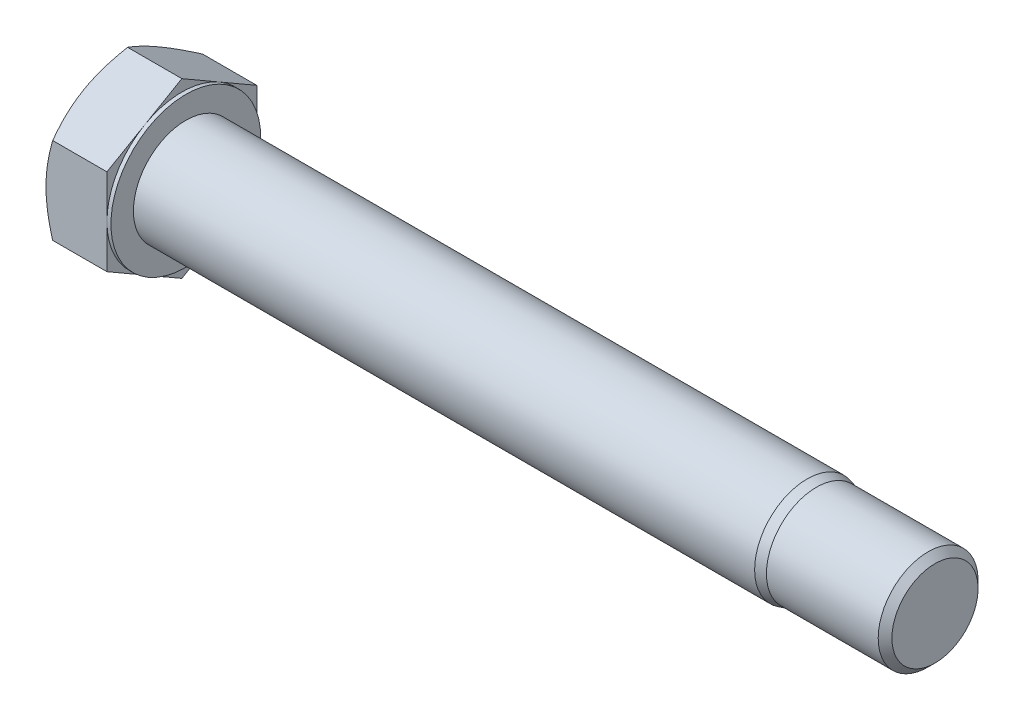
ISO-10303-21;
HEADER;
FILE_DESCRIPTION(('STEP AP214'),'2;1');
FILE_NAME('part.step','',(''),(''),'','','');
FILE_SCHEMA(('AUTOMOTIVE_DESIGN { 1 0 10303 214 1 1 1 1 }'));
ENDSEC;
DATA;
#1=APPLICATION_CONTEXT('core data for automotive mechanical design processes');
#2=APPLICATION_PROTOCOL_DEFINITION('international standard','automotive_design',2000,#1);
#3=PRODUCT_CONTEXT('',#1,'mechanical');
#4=PRODUCT('Part','Part','',(#3));
#5=PRODUCT_RELATED_PRODUCT_CATEGORY('part','',(#4));
#6=PRODUCT_DEFINITION_FORMATION('','',#4);
#7=PRODUCT_DEFINITION_CONTEXT('part definition',#1,'design');
#8=PRODUCT_DEFINITION('design','',#6,#7);
#9=PRODUCT_DEFINITION_SHAPE('','',#8);
#10=(LENGTH_UNIT() NAMED_UNIT(*) SI_UNIT(.MILLI.,.METRE.));
#11=(NAMED_UNIT(*) PLANE_ANGLE_UNIT() SI_UNIT($,.RADIAN.));
#12=(NAMED_UNIT(*) SI_UNIT($,.STERADIAN.) SOLID_ANGLE_UNIT());
#13=UNCERTAINTY_MEASURE_WITH_UNIT(LENGTH_MEASURE(1.E-05),#10,'distance_accuracy_value','');
#14=(GEOMETRIC_REPRESENTATION_CONTEXT(3) GLOBAL_UNCERTAINTY_ASSIGNED_CONTEXT((#13)) GLOBAL_UNIT_ASSIGNED_CONTEXT((#10,
#11,#12)) REPRESENTATION_CONTEXT('',''));
#15=CARTESIAN_POINT('',(0.,0.,0.));
#16=DIRECTION('',(0.,0.,1.));
#17=DIRECTION('',(1.,0.,0.));
#18=AXIS2_PLACEMENT_3D('',#15,#16,#17);
#19=CARTESIAN_POINT('',(13.,17.3205080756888,0.));
#20=DIRECTION('',(1.,0.,0.));
#21=DIRECTION('',(0.,0.,-1.));
#22=AXIS2_PLACEMENT_3D('',#19,#20,#21);
#23=PLANE('',#22);
#24=CARTESIAN_POINT('',(13.,0.,0.));
#25=DIRECTION('',(1.,0.,0.));
#26=DIRECTION('',(0.,0.,-1.));
#27=AXIS2_PLACEMENT_3D('',#24,#25,#26);
#28=CIRCLE('',#27,10.5);
#29=CARTESIAN_POINT('',(13.,0.,-10.5));
#30=VERTEX_POINT('',#29);
#31=EDGE_CURVE('E325',#30,#30,#28,.F.);
#32=ORIENTED_EDGE('',*,*,#31,.T.);
#33=EDGE_LOOP('',(#32));
#34=FACE_BOUND('',#33,.T.);
#35=CARTESIAN_POINT('',(13.,0.,0.));
#36=DIRECTION('',(1.,0.,0.));
#37=DIRECTION('',(0.,0.,-1.));
#38=AXIS2_PLACEMENT_3D('',#35,#36,#37);
#39=CIRCLE('',#38,15.);
#40=CARTESIAN_POINT('',(13.,0.,-15.));
#41=VERTEX_POINT('',#40);
#42=EDGE_CURVE('E338',#41,#41,#39,.T.);
#43=ORIENTED_EDGE('',*,*,#42,.T.);
#44=EDGE_LOOP('',(#43));
#45=FACE_BOUND('',#44,.T.);
#46=ADVANCED_FACE('F33',(#34,#45),#23,.T.);
#47=CARTESIAN_POINT('',(0.,0.,0.));
#48=DIRECTION('',(-1.,0.,0.));
#49=DIRECTION('',(0.,0.,1.));
#50=AXIS2_PLACEMENT_3D('',#47,#48,#49);
#51=CYLINDRICAL_SURFACE('',#50,10.5);
#52=ORIENTED_EDGE('',*,*,#31,.F.);
#53=EDGE_LOOP('',(#52));
#54=FACE_BOUND('',#53,.T.);
#55=CARTESIAN_POINT('',(137.383974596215,0.,0.));
#56=DIRECTION('',(-1.,0.,0.));
#57=DIRECTION('',(0.,0.,1.));
#58=AXIS2_PLACEMENT_3D('',#55,#56,#57);
#59=CIRCLE('',#58,10.5);
#60=CARTESIAN_POINT('',(137.383974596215,0.,10.5));
#61=VERTEX_POINT('',#60);
#62=EDGE_CURVE('E328',#61,#61,#59,.T.);
#63=ORIENTED_EDGE('',*,*,#62,.T.);
#64=EDGE_LOOP('',(#63));
#65=FACE_BOUND('',#64,.T.);
#66=ADVANCED_FACE('F242',(#54,#65),#51,.T.);
#67=CARTESIAN_POINT('',(139.25,0.,0.));
#68=DIRECTION('',(-1.,0.,0.));
#69=DIRECTION('',(0.,0.,1.));
#70=AXIS2_PLACEMENT_3D('',#67,#68,#69);
#71=CONICAL_SURFACE('',#70,9.99999999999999,0.261799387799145);
#72=ORIENTED_EDGE('',*,*,#62,.F.);
#73=EDGE_LOOP('',(#72));
#74=FACE_BOUND('',#73,.T.);
#75=CARTESIAN_POINT('',(139.25,0.,0.));
#76=DIRECTION('',(-1.,0.,0.));
#77=DIRECTION('',(0.,0.,1.));
#78=AXIS2_PLACEMENT_3D('',#75,#76,#77);
#79=CIRCLE('',#78,9.99999999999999);
#80=CARTESIAN_POINT('',(139.25,0.,9.99999999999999));
#81=VERTEX_POINT('',#80);
#82=EDGE_CURVE('E277',#81,#81,#79,.T.);
#83=ORIENTED_EDGE('',*,*,#82,.T.);
#84=EDGE_LOOP('',(#83));
#85=FACE_BOUND('',#84,.T.);
#86=ADVANCED_FACE('F247',(#74,#85),#71,.T.);
#87=CARTESIAN_POINT('',(0.,0.,0.));
#88=DIRECTION('',(-1.,0.,0.));
#89=DIRECTION('',(0.,0.,1.));
#90=AXIS2_PLACEMENT_3D('',#87,#88,#89);
#91=CYLINDRICAL_SURFACE('',#90,10.);
#92=ORIENTED_EDGE('',*,*,#82,.F.);
#93=EDGE_LOOP('',(#92));
#94=FACE_BOUND('',#93,.T.);
#95=CARTESIAN_POINT('',(161.626,0.,0.));
#96=DIRECTION('',(-1.,0.,0.));
#97=DIRECTION('',(0.,0.,1.));
#98=AXIS2_PLACEMENT_3D('',#95,#96,#97);
#99=CIRCLE('',#98,10.0000000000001);
#100=CARTESIAN_POINT('',(161.626,0.,10.0000000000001));
#101=VERTEX_POINT('',#100);
#102=EDGE_CURVE('E275',#101,#101,#99,.T.);
#103=ORIENTED_EDGE('',*,*,#102,.T.);
#104=EDGE_LOOP('',(#103));
#105=FACE_BOUND('',#104,.T.);
#106=ADVANCED_FACE('F255',(#94,#105),#91,.T.);
#107=CARTESIAN_POINT('',(163.,0.,0.));
#108=DIRECTION('',(-1.,0.,0.));
#109=DIRECTION('',(0.,0.,1.));
#110=AXIS2_PLACEMENT_3D('',#107,#108,#109);
#111=CONICAL_SURFACE('',#110,8.626,0.785398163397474);
#112=ORIENTED_EDGE('',*,*,#102,.F.);
#113=EDGE_LOOP('',(#112));
#114=FACE_BOUND('',#113,.T.);
#115=CARTESIAN_POINT('',(163.,0.,0.));
#116=DIRECTION('',(-1.,0.,0.));
#117=DIRECTION('',(0.,0.,1.));
#118=AXIS2_PLACEMENT_3D('',#115,#116,#117);
#119=CIRCLE('',#118,8.626);
#120=CARTESIAN_POINT('',(163.,0.,8.626));
#121=VERTEX_POINT('',#120);
#122=EDGE_CURVE('E229',#121,#121,#119,.T.);
#123=ORIENTED_EDGE('',*,*,#122,.T.);
#124=EDGE_LOOP('',(#123));
#125=FACE_BOUND('',#124,.T.);
#126=ADVANCED_FACE('F259',(#114,#125),#111,.T.);
#127=CARTESIAN_POINT('',(163.,0.,0.));
#128=DIRECTION('',(-1.,0.,0.));
#129=DIRECTION('',(0.,0.,1.));
#130=AXIS2_PLACEMENT_3D('',#127,#128,#129);
#131=PLANE('',#130);
#132=ORIENTED_EDGE('',*,*,#122,.F.);
#133=EDGE_LOOP('',(#132));
#134=FACE_BOUND('',#133,.T.);
#135=ADVANCED_FACE('F262',(#134),#131,.F.);
#136=CARTESIAN_POINT('',(12.2,15.,0.));
#137=DIRECTION('',(1.,0.,0.));
#138=DIRECTION('',(0.,0.,-1.));
#139=AXIS2_PLACEMENT_3D('',#136,#137,#138);
#140=PLANE('',#139);
#141=DIRECTION('',(0.,0.500000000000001,0.866025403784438));
#142=VECTOR('',#141,1.);
#143=CARTESIAN_POINT('',(12.2,8.66025403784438,-15.));
#144=LINE('',#143,#142);
#145=CARTESIAN_POINT('',(12.2,8.66025403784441,-15.));
#146=VERTEX_POINT('',#145);
#147=CARTESIAN_POINT('',(12.2,12.9903810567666,-7.50000000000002));
#148=VERTEX_POINT('',#147);
#149=EDGE_CURVE('E166',#146,#148,#144,.T.);
#150=ORIENTED_EDGE('',*,*,#149,.T.);
#151=CARTESIAN_POINT('',(12.2,0.,0.));
#152=DIRECTION('',(-1.,0.,0.));
#153=DIRECTION('',(0.,0.,1.));
#154=AXIS2_PLACEMENT_3D('',#151,#152,#153);
#155=CIRCLE('',#154,15.);
#156=CARTESIAN_POINT('',(12.2,0.,-15.));
#157=VERTEX_POINT('',#156);
#158=EDGE_CURVE('E49',#148,#157,#155,.T.);
#159=ORIENTED_EDGE('',*,*,#158,.T.);
#160=DIRECTION('',(0.,1.,0.));
#161=VECTOR('',#160,1.);
#162=CARTESIAN_POINT('',(12.2,8.66025403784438,-15.));
#163=LINE('',#162,#161);
#164=EDGE_CURVE('E38',#157,#146,#163,.T.);
#165=ORIENTED_EDGE('',*,*,#164,.T.);
#166=EDGE_LOOP('',(#150,#159,#165));
#167=FACE_BOUND('',#166,.T.);
#168=ADVANCED_FACE('F265',(#167),#140,.T.);
#169=CARTESIAN_POINT('',(12.2,17.3205080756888,0.));
#170=VERTEX_POINT('',#169);
#171=EDGE_CURVE('E164',#148,#170,#144,.T.);
#172=ORIENTED_EDGE('',*,*,#171,.T.);
#173=DIRECTION('',(0.,-0.500000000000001,0.866025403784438));
#174=VECTOR('',#173,1.);
#175=CARTESIAN_POINT('',(12.2,17.3205080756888,0.));
#176=LINE('',#175,#174);
#177=CARTESIAN_POINT('',(12.2,12.9903810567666,7.50000000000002));
#178=VERTEX_POINT('',#177);
#179=EDGE_CURVE('E163',#170,#178,#176,.T.);
#180=ORIENTED_EDGE('',*,*,#179,.T.);
#181=EDGE_CURVE('E152',#178,#148,#155,.T.);
#182=ORIENTED_EDGE('',*,*,#181,.T.);
#183=EDGE_LOOP('',(#172,#180,#182));
#184=FACE_BOUND('',#183,.T.);
#185=ADVANCED_FACE('F270',(#184),#140,.T.);
#186=CARTESIAN_POINT('',(12.2,8.66025403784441,15.));
#187=VERTEX_POINT('',#186);
#188=EDGE_CURVE('E131',#178,#187,#176,.T.);
#189=ORIENTED_EDGE('',*,*,#188,.T.);
#190=DIRECTION('',(0.,-1.,0.));
#191=VECTOR('',#190,1.);
#192=CARTESIAN_POINT('',(12.2,8.66025403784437,15.));
#193=LINE('',#192,#191);
#194=CARTESIAN_POINT('',(12.2,0.,15.));
#195=VERTEX_POINT('',#194);
#196=EDGE_CURVE('E125',#187,#195,#193,.T.);
#197=ORIENTED_EDGE('',*,*,#196,.T.);
#198=EDGE_CURVE('E129',#195,#178,#155,.T.);
#199=ORIENTED_EDGE('',*,*,#198,.T.);
#200=EDGE_LOOP('',(#189,#197,#199));
#201=FACE_BOUND('',#200,.T.);
#202=ADVANCED_FACE('F127',(#201),#140,.T.);
#203=CARTESIAN_POINT('',(12.2,-8.6602540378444,15.));
#204=VERTEX_POINT('',#203);
#205=EDGE_CURVE('E135',#195,#204,#193,.T.);
#206=ORIENTED_EDGE('',*,*,#205,.T.);
#207=DIRECTION('',(0.,-0.500000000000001,-0.866025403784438));
#208=VECTOR('',#207,1.);
#209=CARTESIAN_POINT('',(12.2,-17.3205080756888,0.));
#210=LINE('',#209,#208);
#211=CARTESIAN_POINT('',(12.2,-12.9903810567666,7.50000000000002));
#212=VERTEX_POINT('',#211);
#213=EDGE_CURVE('E142',#204,#212,#210,.T.);
#214=ORIENTED_EDGE('',*,*,#213,.T.);
#215=EDGE_CURVE('E139',#212,#195,#155,.T.);
#216=ORIENTED_EDGE('',*,*,#215,.T.);
#217=EDGE_LOOP('',(#206,#214,#216));
#218=FACE_BOUND('',#217,.T.);
#219=ADVANCED_FACE('F140',(#218),#140,.T.);
#220=CARTESIAN_POINT('',(12.2,-17.3205080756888,0.));
#221=VERTEX_POINT('',#220);
#222=EDGE_CURVE('E158',#212,#221,#210,.T.);
#223=ORIENTED_EDGE('',*,*,#222,.T.);
#224=DIRECTION('',(0.,0.5,-0.866025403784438));
#225=VECTOR('',#224,1.);
#226=CARTESIAN_POINT('',(12.2,-8.66025403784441,-15.));
#227=LINE('',#226,#225);
#228=CARTESIAN_POINT('',(12.2,-12.9903810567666,-7.50000000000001));
#229=VERTEX_POINT('',#228);
#230=EDGE_CURVE('E351',#221,#229,#227,.T.);
#231=ORIENTED_EDGE('',*,*,#230,.T.);
#232=EDGE_CURVE('E146',#229,#212,#155,.T.);
#233=ORIENTED_EDGE('',*,*,#232,.T.);
#234=EDGE_LOOP('',(#223,#231,#233));
#235=FACE_BOUND('',#234,.T.);
#236=ADVANCED_FACE('F353',(#235),#140,.T.);
#237=CARTESIAN_POINT('',(12.2,-8.6602540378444,-15.));
#238=VERTEX_POINT('',#237);
#239=EDGE_CURVE('E153',#229,#238,#227,.T.);
#240=ORIENTED_EDGE('',*,*,#239,.T.);
#241=EDGE_CURVE('E11',#238,#157,#163,.T.);
#242=ORIENTED_EDGE('',*,*,#241,.T.);
#243=EDGE_CURVE('E350',#157,#229,#155,.T.);
#244=ORIENTED_EDGE('',*,*,#243,.T.);
#245=EDGE_LOOP('',(#240,#242,#244));
#246=FACE_BOUND('',#245,.T.);
#247=ADVANCED_FACE('F271',(#246),#140,.T.);
#248=CARTESIAN_POINT('',(0.,0.,0.));
#249=DIRECTION('',(-1.,0.,0.));
#250=DIRECTION('',(0.,0.,1.));
#251=AXIS2_PLACEMENT_3D('',#248,#249,#250);
#252=CYLINDRICAL_SURFACE('',#251,15.);
#253=ORIENTED_EDGE('',*,*,#158,.F.);
#254=ORIENTED_EDGE('',*,*,#181,.F.);
#255=ORIENTED_EDGE('',*,*,#198,.F.);
#256=ORIENTED_EDGE('',*,*,#215,.F.);
#257=ORIENTED_EDGE('',*,*,#232,.F.);
#258=ORIENTED_EDGE('',*,*,#243,.F.);
#259=EDGE_LOOP('',(#253,#254,#255,#256,#257,#258));
#260=FACE_BOUND('',#259,.T.);
#261=ORIENTED_EDGE('',*,*,#42,.F.);
#262=EDGE_LOOP('',(#261));
#263=FACE_BOUND('',#262,.T.);
#264=ADVANCED_FACE('F149',(#260,#263),#252,.T.);
#265=CARTESIAN_POINT('',(0.,17.3205080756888,0.));
#266=DIRECTION('',(1.,0.,0.));
#267=DIRECTION('',(0.,0.,-1.));
#268=AXIS2_PLACEMENT_3D('',#265,#266,#267);
#269=PLANE('',#268);
#270=CARTESIAN_POINT('',(0.,0.,0.));
#271=DIRECTION('',(1.,0.,0.));
#272=DIRECTION('',(0.,0.,-1.));
#273=AXIS2_PLACEMENT_3D('',#270,#271,#272);
#274=CIRCLE('',#273,15.);
#275=CARTESIAN_POINT('',(0.,0.,-15.));
#276=VERTEX_POINT('',#275);
#277=CARTESIAN_POINT('',(0.,12.9903810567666,-7.50000000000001));
#278=VERTEX_POINT('',#277);
#279=EDGE_CURVE('E337',#276,#278,#274,.T.);
#280=ORIENTED_EDGE('',*,*,#279,.F.);
#281=CARTESIAN_POINT('',(0.,-12.9903810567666,-7.50000000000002));
#282=VERTEX_POINT('',#281);
#283=EDGE_CURVE('E336',#282,#276,#274,.T.);
#284=ORIENTED_EDGE('',*,*,#283,.F.);
#285=CARTESIAN_POINT('',(0.,-12.9903810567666,7.50000000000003));
#286=VERTEX_POINT('',#285);
#287=EDGE_CURVE('E295',#286,#282,#274,.T.);
#288=ORIENTED_EDGE('',*,*,#287,.F.);
#289=CARTESIAN_POINT('',(0.,0.,15.));
#290=VERTEX_POINT('',#289);
#291=EDGE_CURVE('E305',#290,#286,#274,.T.);
#292=ORIENTED_EDGE('',*,*,#291,.F.);
#293=CARTESIAN_POINT('',(0.,12.9903810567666,7.50000000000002));
#294=VERTEX_POINT('',#293);
#295=EDGE_CURVE('E313',#294,#290,#274,.T.);
#296=ORIENTED_EDGE('',*,*,#295,.F.);
#297=EDGE_CURVE('E318',#278,#294,#274,.T.);
#298=ORIENTED_EDGE('',*,*,#297,.F.);
#299=EDGE_LOOP('',(#280,#284,#288,#292,#296,#298));
#300=FACE_BOUND('',#299,.T.);
#301=ADVANCED_FACE('F193',(#300),#269,.F.);
#302=CARTESIAN_POINT('',(-3.75000000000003,0.,0.));
#303=DIRECTION('',(1.,0.,0.));
#304=DIRECTION('',(0.,0.,-1.));
#305=AXIS2_PLACEMENT_3D('',#302,#303,#304);
#306=CONICAL_SURFACE('',#305,8.50480947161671,1.04719755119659);
#307=CARTESIAN_POINT('',(1.33981262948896,17.3206235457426,0.000200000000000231));
#308=CARTESIAN_POINT('',(1.22992178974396,17.130274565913,-0.329494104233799));
#309=CARTESIAN_POINT('',(1.12501758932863,16.939183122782,-0.6604741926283));
#310=CARTESIAN_POINT('',(0.926568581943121,16.5554679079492,-1.32508844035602));
#311=CARTESIAN_POINT('',(0.83302751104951,16.3628436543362,-1.6587234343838));
#312=CARTESIAN_POINT('',(0.658562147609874,15.9756905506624,-2.32929228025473));
#313=CARTESIAN_POINT('',(0.5776677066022,15.7811583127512,-2.66623200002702));
#314=CARTESIAN_POINT('',(0.430232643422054,15.3907420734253,-3.34245276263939));
#315=CARTESIAN_POINT('',(0.363691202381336,15.1948581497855,-3.68173367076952));
#316=CARTESIAN_POINT('',(0.247792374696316,14.8067578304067,-4.35394314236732));
#317=CARTESIAN_POINT('',(0.198051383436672,14.6145702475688,-4.68682180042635));
#318=CARTESIAN_POINT('',(0.114646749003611,14.2293144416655,-5.3541044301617));
#319=CARTESIAN_POINT('',(0.08098341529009,14.0362462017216,-5.6885084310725));
#320=CARTESIAN_POINT('',(0.0305840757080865,13.6497853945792,-6.35787818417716));
#321=CARTESIAN_POINT('',(0.0138279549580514,13.4563934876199,-6.69284279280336));
#322=CARTESIAN_POINT('',(-0.00239660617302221,13.0694311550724,-7.36308121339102));
#323=CARTESIAN_POINT('',(-0.00186558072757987,12.8758607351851,-7.69835501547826));
#324=CARTESIAN_POINT('',(0.0152766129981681,12.5139822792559,-8.32514688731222));
#325=CARTESIAN_POINT('',(0.0297968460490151,12.3456484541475,-8.61670962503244));
#326=CARTESIAN_POINT('',(0.0716371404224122,12.0093680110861,-9.19916443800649));
#327=CARTESIAN_POINT('',(0.098958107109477,11.8414214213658,-9.4900564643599));
#328=CARTESIAN_POINT('',(0.165923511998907,11.5060066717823,-10.0710118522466));
#329=CARTESIAN_POINT('',(0.205578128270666,11.338539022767,-10.3610743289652));
#330=CARTESIAN_POINT('',(0.296515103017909,11.0043888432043,-10.939839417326));
#331=CARTESIAN_POINT('',(0.347798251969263,10.8377063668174,-11.2285419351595));
#332=CARTESIAN_POINT('',(0.520386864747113,10.3317324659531,-12.1049144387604));
#333=CARTESIAN_POINT('',(0.658901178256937,9.99390625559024,-12.6900465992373));
#334=CARTESIAN_POINT('',(0.973271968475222,9.32329122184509,-13.8515859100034));
#335=CARTESIAN_POINT('',(1.14905461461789,8.99049381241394,-14.4280079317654));
#336=CARTESIAN_POINT('',(1.33981262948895,8.66013856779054,-15.0002));
#337=B_SPLINE_CURVE_WITH_KNOTS('',3,(#307,#308,#309,#310,#311,#312,#313,#314,#315,#316,#317,
#318,#319,#320,#321,#322,#323,#324,#325,#326,#327,#328,#329,#330,#331,#332,#333,#334,#335,#336),
.UNSPECIFIED.,.F.,.F.,(4,2,2,2,2,2,2,2,2,2,2,2,2,2,4),(0.,1.18875411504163,2.37789802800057,
3.56980778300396,4.76164951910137,5.9240737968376,7.08652044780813,8.2475824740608,
9.40860862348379,10.4193068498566,11.4300765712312,12.4416826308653,13.4533574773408,
15.5211962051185,17.5849760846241),.UNSPECIFIED.);
#338=CARTESIAN_POINT('',(1.33974596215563,17.3205080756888,0.));
#339=VERTEX_POINT('',#338);
#340=EDGE_CURVE('E57',#339,#278,#337,.T.);
#341=ORIENTED_EDGE('',*,*,#340,.T.);
#342=ORIENTED_EDGE('',*,*,#297,.T.);
#343=CARTESIAN_POINT('',(1.33981262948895,8.66013856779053,15.0002));
#344=CARTESIAN_POINT('',(1.22992178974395,8.85048754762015,14.6705058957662));
#345=CARTESIAN_POINT('',(1.12501758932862,9.04157899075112,14.3395258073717));
#346=CARTESIAN_POINT('',(0.926568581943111,9.42529420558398,13.674911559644));
#347=CARTESIAN_POINT('',(0.8330275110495,9.617918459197,13.3412765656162));
#348=CARTESIAN_POINT('',(0.658562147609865,10.0050715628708,12.6707077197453));
#349=CARTESIAN_POINT('',(0.577667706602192,10.199603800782,12.333767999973));
#350=CARTESIAN_POINT('',(0.430232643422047,10.5900200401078,11.6575472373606));
#351=CARTESIAN_POINT('',(0.36369120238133,10.7859039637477,11.3182663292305));
#352=CARTESIAN_POINT('',(0.24779237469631,11.1740042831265,10.6460568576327));
#353=CARTESIAN_POINT('',(0.198051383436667,11.3661918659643,10.3131781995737));
#354=CARTESIAN_POINT('',(0.114646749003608,11.7514476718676,9.6458955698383));
#355=CARTESIAN_POINT('',(0.0809834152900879,11.9445159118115,9.3114915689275));
#356=CARTESIAN_POINT('',(0.0305840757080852,12.3309767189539,8.64212181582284));
#357=CARTESIAN_POINT('',(0.01382795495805,12.5243686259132,8.30715720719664));
#358=CARTESIAN_POINT('',(-0.0023966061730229,12.9113309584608,7.63691878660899));
#359=CARTESIAN_POINT('',(-0.00186558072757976,13.1049013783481,7.30164498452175));
#360=CARTESIAN_POINT('',(0.0152766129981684,13.4667798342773,6.67485311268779));
#361=CARTESIAN_POINT('',(0.029796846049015,13.6351136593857,6.38329037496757));
#362=CARTESIAN_POINT('',(0.071637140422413,13.9713941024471,5.80083556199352));
#363=CARTESIAN_POINT('',(0.098958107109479,14.1393406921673,5.50994353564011));
#364=CARTESIAN_POINT('',(0.165923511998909,14.4747554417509,4.92898814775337));
#365=CARTESIAN_POINT('',(0.205578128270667,14.6422230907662,4.63892567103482));
#366=CARTESIAN_POINT('',(0.296515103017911,14.9763732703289,4.06016058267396));
#367=CARTESIAN_POINT('',(0.347798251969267,15.1430557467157,3.77145806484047));
#368=CARTESIAN_POINT('',(0.520386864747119,15.6490296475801,2.89508556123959));
#369=CARTESIAN_POINT('',(0.658901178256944,15.9868558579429,2.30995340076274));
#370=CARTESIAN_POINT('',(0.973271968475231,16.6574708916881,1.14841408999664));
#371=CARTESIAN_POINT('',(1.1490546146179,16.9902683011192,0.571992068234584));
#372=CARTESIAN_POINT('',(1.33981262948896,17.3206235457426,-0.000200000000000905));
#373=B_SPLINE_CURVE_WITH_KNOTS('',3,(#343,#344,#345,#346,#347,#348,#349,#350,#351,#352,#353,
#354,#355,#356,#357,#358,#359,#360,#361,#362,#363,#364,#365,#366,#367,#368,#369,#370,#371,#372),
.UNSPECIFIED.,.F.,.F.,(4,2,2,2,2,2,2,2,2,2,2,2,2,2,4),(0.,1.18875411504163,2.37789802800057,
3.56980778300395,4.76164951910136,5.92407379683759,7.08652044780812,8.24758247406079,
9.40860862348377,10.4193068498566,11.4300765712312,12.4416826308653,13.4533574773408,
15.5211962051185,17.5849760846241),.UNSPECIFIED.);
#374=EDGE_CURVE('E228',#294,#339,#373,.T.);
#375=ORIENTED_EDGE('',*,*,#374,.T.);
#376=EDGE_LOOP('',(#341,#342,#375));
#377=FACE_BOUND('',#376,.T.);
#378=ADVANCED_FACE('F182',(#377),#306,.T.);
#379=CARTESIAN_POINT('',(1.33974596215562,8.66025403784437,15.));
#380=VERTEX_POINT('',#379);
#381=EDGE_CURVE('E223',#380,#294,#373,.T.);
#382=ORIENTED_EDGE('',*,*,#381,.T.);
#383=ORIENTED_EDGE('',*,*,#295,.T.);
#384=CARTESIAN_POINT('',(7.34067071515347,-23.3042652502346,15.));
#385=CARTESIAN_POINT('',(7.18156779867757,-22.9765341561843,15.));
#386=CARTESIAN_POINT('',(7.02325509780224,-22.648419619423,15.));
#387=CARTESIAN_POINT('',(6.70838900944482,-21.9913436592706,15.));
#388=CARTESIAN_POINT('',(6.55183563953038,-21.6623822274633,15.));
#389=CARTESIAN_POINT('',(6.08504186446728,-20.6740205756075,15.));
#390=CARTESIAN_POINT('',(5.77771466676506,-20.013239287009,15.));
#391=CARTESIAN_POINT('',(5.17103347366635,-18.6836927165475,15.));
#392=CARTESIAN_POINT('',(4.87173163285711,-18.0149035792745,15.));
#393=CARTESIAN_POINT('',(4.28531537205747,-16.672021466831,15.));
#394=CARTESIAN_POINT('',(3.99820037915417,-15.997928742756,15.));
#395=CARTESIAN_POINT('',(3.43032614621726,-14.6214178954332,15.));
#396=CARTESIAN_POINT('',(3.15007396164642,-13.9187894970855,15.));
#397=CARTESIAN_POINT('',(2.61067811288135,-12.5053227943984,15.));
#398=CARTESIAN_POINT('',(2.35153681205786,-11.7944835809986,15.));
#399=CARTESIAN_POINT('',(1.86113921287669,-10.3648046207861,15.));
#400=CARTESIAN_POINT('',(1.62982681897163,-9.64598427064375,15.));
#401=CARTESIAN_POINT('',(1.2024688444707,-8.1979641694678,15.));
#402=CARTESIAN_POINT('',(1.00641219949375,-7.4687677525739,15.));
#403=CARTESIAN_POINT('',(0.74638148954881,-6.36908708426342,15.));
#404=CARTESIAN_POINT('',(0.665556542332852,-6.00256349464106,15.));
#405=CARTESIAN_POINT('',(0.516215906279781,-5.26700410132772,15.));
#406=CARTESIAN_POINT('',(0.447699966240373,-4.89796834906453,15.));
#407=CARTESIAN_POINT('',(0.324184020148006,-4.1576349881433,15.));
#408=CARTESIAN_POINT('',(0.269183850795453,-3.78633740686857,15.));
#409=CARTESIAN_POINT('',(0.17379552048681,-3.04187310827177,15.));
#410=CARTESIAN_POINT('',(0.133406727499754,-2.66870647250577,15.));
#411=CARTESIAN_POINT('',(0.0685517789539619,-1.92591313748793,15.));
#412=CARTESIAN_POINT('',(0.0438838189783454,-1.55630416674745,15.));
#413=CARTESIAN_POINT('',(0.0102026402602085,-0.816374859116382,15.));
#414=CARTESIAN_POINT('',(0.00118916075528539,-0.44605453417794,15.));
#415=CARTESIAN_POINT('',(-0.000968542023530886,0.294636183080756,15.));
#416=CARTESIAN_POINT('',(0.00588729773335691,0.665006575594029,15.));
#417=CARTESIAN_POINT('',(0.0353005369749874,1.40512739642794,15.));
#418=CARTESIAN_POINT('',(0.0578586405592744,1.77487779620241,15.));
#419=CARTESIAN_POINT('',(0.130359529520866,2.66225131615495,15.));
#420=CARTESIAN_POINT('',(0.187682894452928,3.17928211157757,15.));
#421=CARTESIAN_POINT('',(0.329920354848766,4.20953694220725,15.));
#422=CARTESIAN_POINT('',(0.41483816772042,4.7227604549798,15.));
#423=CARTESIAN_POINT('',(0.609243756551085,5.74490151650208,15.));
#424=CARTESIAN_POINT('',(0.718750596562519,6.25381540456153,15.));
#425=CARTESIAN_POINT('',(0.95899001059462,7.26655289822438,15.));
#426=CARTESIAN_POINT('',(1.0897222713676,7.77037657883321,15.));
#427=CARTESIAN_POINT('',(1.37231868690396,8.78401362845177,15.));
#428=CARTESIAN_POINT('',(1.52458533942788,9.29371400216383,15.));
#429=CARTESIAN_POINT('',(1.84492743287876,10.3080942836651,15.));
#430=CARTESIAN_POINT('',(2.01300297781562,10.8127741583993,15.));
#431=CARTESIAN_POINT('',(2.36228753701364,11.8173612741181,15.));
#432=CARTESIAN_POINT('',(2.5434922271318,12.3172700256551,15.));
#433=CARTESIAN_POINT('',(2.91689581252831,13.3129403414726,15.));
#434=CARTESIAN_POINT('',(3.10909458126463,13.8087019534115,15.));
#435=CARTESIAN_POINT('',(3.57360485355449,14.9746038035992,15.));
#436=CARTESIAN_POINT('',(3.84982124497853,15.6431858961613,15.));
#437=CARTESIAN_POINT('',(4.41563784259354,16.9746795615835,15.));
#438=CARTESIAN_POINT('',(4.70523886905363,17.6375907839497,15.));
#439=CARTESIAN_POINT('',(5.29515643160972,18.9587926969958,15.));
#440=CARTESIAN_POINT('',(5.59547534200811,19.6170823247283,15.));
#441=CARTESIAN_POINT('',(6.20467573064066,20.9296606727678,15.));
#442=CARTESIAN_POINT('',(6.51355702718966,21.5839494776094,15.));
#443=CARTESIAN_POINT('',(7.13862847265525,22.8898994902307,15.));
#444=CARTESIAN_POINT('',(7.45482623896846,23.5415570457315,15.));
#445=CARTESIAN_POINT('',(8.09295875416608,24.8420565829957,15.));
#446=CARTESIAN_POINT('',(8.41489352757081,25.4908985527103,15.));
#447=CARTESIAN_POINT('',(9.0634781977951,26.7861146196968,15.));
#448=CARTESIAN_POINT('',(9.39012748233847,27.4324890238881,15.));
#449=CARTESIAN_POINT('',(10.0474129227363,28.7232086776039,15.));
#450=CARTESIAN_POINT('',(10.3780490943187,29.3675539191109,15.));
#451=CARTESIAN_POINT('',(11.3194716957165,31.1905009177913,15.));
#452=CARTESIAN_POINT('',(11.9342118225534,32.367060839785,15.));
#453=CARTESIAN_POINT('',(13.1721121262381,34.7157851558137,15.));
#454=CARTESIAN_POINT('',(13.7952725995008,35.8879493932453,15.));
#455=CARTESIAN_POINT('',(15.0464839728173,38.2259091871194,15.));
#456=CARTESIAN_POINT('',(15.6745188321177,39.3917133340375,15.));
#457=CARTESIAN_POINT('',(16.6203232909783,41.1383439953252,15.));
#458=CARTESIAN_POINT('',(16.9362082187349,41.720192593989,15.));
#459=CARTESIAN_POINT('',(17.5691038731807,42.8832760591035,15.));
#460=CARTESIAN_POINT('',(17.886114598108,43.4645109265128,15.));
#461=CARTESIAN_POINT('',(18.2036234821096,44.0454736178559,15.));
#462=B_SPLINE_CURVE_WITH_KNOTS('',3,(#384,#385,#386,#387,#388,#389,#390,#391,#392,#393,#394,
#395,#396,#397,#398,#399,#400,#401,#402,#403,#404,#405,#406,#407,#408,#409,#410,#411,#412,#413,
#414,#415,#416,#417,#418,#419,#420,#421,#422,#423,#424,#425,#426,#427,#428,#429,#430,#431,#432,
#433,#434,#435,#436,#437,#438,#439,#440,#441,#442,#443,#444,#445,#446,#447,#448,#449,#450,#451,
#452,#453,#454,#455,#456,#457,#458,#459,#460,#461),.UNSPECIFIED.,.F.,.F.,(4,2,2,2,2,2,2,2,2,2,2,
2,2,2,2,2,2,2,2,2,2,2,2,2,2,2,2,2,2,2,2,2,2,2,2,2,2,2,4),(0.,1.0929265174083,2.18586393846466,
4.37206003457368,6.5700882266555,8.76801297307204,11.037126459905,13.3064936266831,
15.5712068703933,17.8352081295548,18.9610232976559,20.0868154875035,21.2125940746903,
22.3383239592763,23.4492954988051,24.5602485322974,25.6712059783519,26.7822132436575,
28.3419475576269,29.9018920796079,31.4630502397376,33.0241853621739,34.6197538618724,
36.2153328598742,37.8103887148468,39.4054262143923,41.5754079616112,43.7455228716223,
45.9161215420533,48.0866741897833,50.2595985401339,52.4325321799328,54.6051861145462,
56.7778486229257,60.7602319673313,64.7427558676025,68.715363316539,70.7015596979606,
72.6877529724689),.UNSPECIFIED.);
#463=EDGE_CURVE('E222',#290,#380,#462,.T.);
#464=ORIENTED_EDGE('',*,*,#463,.T.);
#465=EDGE_LOOP('',(#382,#383,#464));
#466=FACE_BOUND('',#465,.T.);
#467=ADVANCED_FACE('F311',(#466),#306,.T.);
#468=CARTESIAN_POINT('',(1.33974596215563,-8.6602540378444,15.));
#469=VERTEX_POINT('',#468);
#470=EDGE_CURVE('E217',#469,#290,#462,.T.);
#471=ORIENTED_EDGE('',*,*,#470,.T.);
#472=ORIENTED_EDGE('',*,*,#291,.T.);
#473=CARTESIAN_POINT('',(1.33981262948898,-17.3206235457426,-0.000200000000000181));
#474=CARTESIAN_POINT('',(1.22992178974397,-17.130274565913,0.3294941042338));
#475=CARTESIAN_POINT('',(1.12501758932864,-16.9391831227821,0.660474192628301));
#476=CARTESIAN_POINT('',(0.926568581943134,-16.5554679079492,1.32508844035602));
#477=CARTESIAN_POINT('',(0.833027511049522,-16.3628436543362,1.65872343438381));
#478=CARTESIAN_POINT('',(0.658562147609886,-15.9756905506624,2.32929228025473));
#479=CARTESIAN_POINT('',(0.577667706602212,-15.7811583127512,2.66623200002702));
#480=CARTESIAN_POINT('',(0.430232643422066,-15.3907420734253,3.34245276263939));
#481=CARTESIAN_POINT('',(0.363691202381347,-15.1948581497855,3.68173367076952));
#482=CARTESIAN_POINT('',(0.247792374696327,-14.8067578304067,4.35394314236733));
#483=CARTESIAN_POINT('',(0.198051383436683,-14.6145702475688,4.68682180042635));
#484=CARTESIAN_POINT('',(0.114646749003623,-14.2293144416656,5.35410443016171));
#485=CARTESIAN_POINT('',(0.0809834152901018,-14.0362462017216,5.68850843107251));
#486=CARTESIAN_POINT('',(0.0305840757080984,-13.6497853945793,6.35787818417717));
#487=CARTESIAN_POINT('',(0.0138279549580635,-13.4563934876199,6.69284279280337));
#488=CARTESIAN_POINT('',(-0.00239660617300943,-13.0694311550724,7.36308121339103));
#489=CARTESIAN_POINT('',(-0.00186558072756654,-12.8758607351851,7.69835501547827));
#490=CARTESIAN_POINT('',(0.0152766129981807,-12.5139822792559,8.32514688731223));
#491=CARTESIAN_POINT('',(0.0297968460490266,-12.3456484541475,8.61670962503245));
#492=CARTESIAN_POINT('',(0.0716371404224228,-12.0093680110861,9.1991644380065));
#493=CARTESIAN_POINT('',(0.0989581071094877,-11.8414214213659,9.4900564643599));
#494=CARTESIAN_POINT('',(0.165923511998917,-11.5060066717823,10.0710118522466));
#495=CARTESIAN_POINT('',(0.205578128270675,-11.338539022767,10.3610743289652));
#496=CARTESIAN_POINT('',(0.296515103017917,-11.0043888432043,10.939839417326));
#497=CARTESIAN_POINT('',(0.347798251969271,-10.8377063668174,11.2285419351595));
#498=CARTESIAN_POINT('',(0.520386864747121,-10.3317324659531,12.1049144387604));
#499=CARTESIAN_POINT('',(0.658901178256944,-9.99390625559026,12.6900465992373));
#500=CARTESIAN_POINT('',(0.973271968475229,-9.32329122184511,13.8515859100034));
#501=CARTESIAN_POINT('',(1.14905461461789,-8.99049381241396,14.4280079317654));
#502=CARTESIAN_POINT('',(1.33981262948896,-8.66013856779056,15.0002));
#503=B_SPLINE_CURVE_WITH_KNOTS('',3,(#473,#474,#475,#476,#477,#478,#479,#480,#481,#482,#483,
#484,#485,#486,#487,#488,#489,#490,#491,#492,#493,#494,#495,#496,#497,#498,#499,#500,#501,#502),
.UNSPECIFIED.,.F.,.F.,(4,2,2,2,2,2,2,2,2,2,2,2,2,2,4),(0.,1.18875411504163,2.37789802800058,
3.56980778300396,4.76164951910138,5.92407379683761,7.08652044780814,8.24758247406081,
9.4086086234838,10.4193068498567,11.4300765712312,12.4416826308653,13.4533574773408,
15.5211962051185,17.5849760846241),.UNSPECIFIED.);
#504=EDGE_CURVE('E211',#286,#469,#503,.T.);
#505=ORIENTED_EDGE('',*,*,#504,.T.);
#506=EDGE_LOOP('',(#471,#472,#505));
#507=FACE_BOUND('',#506,.T.);
#508=ADVANCED_FACE('F302',(#507),#306,.T.);
#509=CARTESIAN_POINT('',(1.33974596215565,-17.3205080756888,0.));
#510=VERTEX_POINT('',#509);
#511=EDGE_CURVE('E206',#510,#286,#503,.T.);
#512=ORIENTED_EDGE('',*,*,#511,.T.);
#513=ORIENTED_EDGE('',*,*,#287,.T.);
#514=CARTESIAN_POINT('',(1.33981262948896,-8.66013856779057,-15.0002));
#515=CARTESIAN_POINT('',(1.22992178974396,-8.85048754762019,-14.6705058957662));
#516=CARTESIAN_POINT('',(1.12501758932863,-9.04157899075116,-14.3395258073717));
#517=CARTESIAN_POINT('',(0.926568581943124,-9.42529420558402,-13.674911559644));
#518=CARTESIAN_POINT('',(0.833027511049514,-9.61791845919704,-13.3412765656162));
#519=CARTESIAN_POINT('',(0.658562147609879,-10.0050715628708,-12.6707077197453));
#520=CARTESIAN_POINT('',(0.577667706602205,-10.199603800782,-12.333767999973));
#521=CARTESIAN_POINT('',(0.430232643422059,-10.5900200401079,-11.6575472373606));
#522=CARTESIAN_POINT('',(0.363691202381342,-10.7859039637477,-11.3182663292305));
#523=CARTESIAN_POINT('',(0.247792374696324,-11.1740042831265,-10.6460568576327));
#524=CARTESIAN_POINT('',(0.198051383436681,-11.3661918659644,-10.3131781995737));
#525=CARTESIAN_POINT('',(0.114646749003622,-11.7514476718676,-9.6458955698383));
#526=CARTESIAN_POINT('',(0.0809834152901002,-11.9445159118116,-9.3114915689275));
#527=CARTESIAN_POINT('',(0.0305840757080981,-12.3309767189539,-8.64212181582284));
#528=CARTESIAN_POINT('',(0.0138279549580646,-12.5243686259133,-8.30715720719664));
#529=CARTESIAN_POINT('',(-0.00239660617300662,-12.9113309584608,-7.63691878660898));
#530=CARTESIAN_POINT('',(-0.00186558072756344,-13.1049013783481,-7.30164498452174));
#531=CARTESIAN_POINT('',(0.0152766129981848,-13.4667798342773,-6.67485311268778));
#532=CARTESIAN_POINT('',(0.0297968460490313,-13.6351136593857,-6.38329037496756));
#533=CARTESIAN_POINT('',(0.0716371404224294,-13.9713941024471,-5.80083556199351));
#534=CARTESIAN_POINT('',(0.0989581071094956,-14.1393406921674,-5.5099435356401));
#535=CARTESIAN_POINT('',(0.165923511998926,-14.4747554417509,-4.92898814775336));
#536=CARTESIAN_POINT('',(0.205578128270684,-14.6422230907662,-4.6389256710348));
#537=CARTESIAN_POINT('',(0.296515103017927,-14.9763732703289,-4.06016058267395));
#538=CARTESIAN_POINT('',(0.347798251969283,-15.1430557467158,-3.77145806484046));
#539=CARTESIAN_POINT('',(0.520386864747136,-15.6490296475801,-2.89508556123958));
#540=CARTESIAN_POINT('',(0.658901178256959,-15.9868558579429,-2.30995340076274));
#541=CARTESIAN_POINT('',(0.973271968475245,-16.6574708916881,-1.14841408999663));
#542=CARTESIAN_POINT('',(1.14905461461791,-16.9902683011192,-0.571992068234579));
#543=CARTESIAN_POINT('',(1.33981262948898,-17.3206235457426,0.000200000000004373));
#544=B_SPLINE_CURVE_WITH_KNOTS('',3,(#514,#515,#516,#517,#518,#519,#520,#521,#522,#523,#524,
#525,#526,#527,#528,#529,#530,#531,#532,#533,#534,#535,#536,#537,#538,#539,#540,#541,#542,#543),
.UNSPECIFIED.,.F.,.F.,(4,2,2,2,2,2,2,2,2,2,2,2,2,2,4),(0.,1.18875411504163,2.37789802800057,
3.56980778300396,4.76164951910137,5.9240737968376,7.08652044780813,8.2475824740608,
9.40860862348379,10.4193068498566,11.4300765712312,12.4416826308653,13.4533574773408,
15.5211962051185,17.5849760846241),.UNSPECIFIED.);
#545=EDGE_CURVE('E212',#282,#510,#544,.T.);
#546=ORIENTED_EDGE('',*,*,#545,.T.);
#547=EDGE_LOOP('',(#512,#513,#546));
#548=FACE_BOUND('',#547,.T.);
#549=ADVANCED_FACE('F292',(#548),#306,.T.);
#550=CARTESIAN_POINT('',(7.34067071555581,-23.3042652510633,-15.));
#551=CARTESIAN_POINT('',(7.18156779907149,-22.9765341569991,-15.));
#552=CARTESIAN_POINT('',(7.02325509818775,-22.6484196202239,-15.));
#553=CARTESIAN_POINT('',(6.70838900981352,-21.9913436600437,-15.));
#554=CARTESIAN_POINT('',(6.55183563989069,-21.6623822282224,-15.));
#555=CARTESIAN_POINT('',(6.08504186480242,-20.6740205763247,-15.));
#556=CARTESIAN_POINT('',(5.77771466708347,-20.0132392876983,-15.));
#557=CARTESIAN_POINT('',(5.17103347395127,-18.6836927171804,-15.));
#558=CARTESIAN_POINT('',(4.87173163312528,-18.0149035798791,-15.));
#559=CARTESIAN_POINT('',(4.28531537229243,-16.6720214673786,-15.));
#560=CARTESIAN_POINT('',(3.99820037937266,-15.997928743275,-15.));
#561=CARTESIAN_POINT('',(3.43032614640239,-14.6214178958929,-15.));
#562=CARTESIAN_POINT('',(3.15007396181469,-13.9187894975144,-15.));
#563=CARTESIAN_POINT('',(2.61067811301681,-12.5053227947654,-15.));
#564=CARTESIAN_POINT('',(2.35153681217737,-11.7944835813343,-15.));
#565=CARTESIAN_POINT('',(1.86113921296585,-10.3648046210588,-15.));
#566=CARTESIAN_POINT('',(1.62982681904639,-9.64598427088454,-15.));
#567=CARTESIAN_POINT('',(1.20246884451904,-8.19796416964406,-15.));
#568=CARTESIAN_POINT('',(1.00641219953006,-7.46876775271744,-15.));
#569=CARTESIAN_POINT('',(0.74638148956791,-6.36908708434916,-15.));
#570=CARTESIAN_POINT('',(0.665556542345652,-6.00256349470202,-15.));
#571=CARTESIAN_POINT('',(0.516215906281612,-5.26700410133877,-15.));
#572=CARTESIAN_POINT('',(0.447699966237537,-4.89796834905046,-15.));
#573=CARTESIAN_POINT('',(0.324184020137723,-4.1576349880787,-15.));
#574=CARTESIAN_POINT('',(0.26918385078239,-3.78633740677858,-15.));
#575=CARTESIAN_POINT('',(0.173795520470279,-3.04187310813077,-15.));
#576=CARTESIAN_POINT('',(0.133406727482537,-2.66870647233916,-15.));
#577=CARTESIAN_POINT('',(0.068551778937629,-1.92591313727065,-15.));
#578=CARTESIAN_POINT('',(0.043883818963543,-1.5563041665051,-15.));
#579=CARTESIAN_POINT('',(0.010202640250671,-0.816374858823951,-15.));
#580=CARTESIAN_POINT('',(0.00118916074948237,-0.446054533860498,-15.));
#581=CARTESIAN_POINT('',(-0.000968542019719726,0.294636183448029,-15.));
#582=CARTESIAN_POINT('',(0.00588729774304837,0.665006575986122,-15.));
#583=CARTESIAN_POINT('',(0.035300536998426,1.40512739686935,-15.));
#584=CARTESIAN_POINT('',(0.0578586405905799,1.7748777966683,-15.));
#585=CARTESIAN_POINT('',(0.130359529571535,2.66225131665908,-15.));
#586=CARTESIAN_POINT('',(0.187682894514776,3.17928211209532,-15.));
#587=CARTESIAN_POINT('',(0.329920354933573,4.20953694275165,-15.));
#588=CARTESIAN_POINT('',(0.414838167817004,4.72276045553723,-15.));
#589=CARTESIAN_POINT('',(0.609243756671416,5.74490151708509,-15.));
#590=CARTESIAN_POINT('',(0.718750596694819,6.2538154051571,-15.));
#591=CARTESIAN_POINT('',(0.958990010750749,7.26655289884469,-15.));
#592=CARTESIAN_POINT('',(1.08972227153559,7.77037657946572,-15.));
#593=CARTESIAN_POINT('',(1.37231868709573,8.78401362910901,-15.));
#594=CARTESIAN_POINT('',(1.52458533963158,9.29371400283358,-15.));
#595=CARTESIAN_POINT('',(1.84492743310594,10.3080942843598,-15.));
#596=CARTESIAN_POINT('',(2.01300297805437,10.8127741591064,-15.));
#597=CARTESIAN_POINT('',(2.36228753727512,11.8173612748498,-15.));
#598=CARTESIAN_POINT('',(2.54349222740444,12.3172700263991,-15.));
#599=CARTESIAN_POINT('',(2.91689581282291,13.3129403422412,-15.));
#600=CARTESIAN_POINT('',(3.10909458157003,13.8087019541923,-15.));
#601=CARTESIAN_POINT('',(3.57360485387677,14.9746038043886,-15.));
#602=CARTESIAN_POINT('',(3.84982124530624,15.6431858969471,-15.));
#603=CARTESIAN_POINT('',(4.41563784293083,16.9746795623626,-15.));
#604=CARTESIAN_POINT('',(4.70523886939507,17.6375907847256,-15.));
#605=CARTESIAN_POINT('',(5.2951564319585,18.9587926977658,-15.));
#606=CARTESIAN_POINT('',(5.59547534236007,19.6170823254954,-15.));
#607=CARTESIAN_POINT('',(6.20467573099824,20.9296606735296,-15.));
#608=CARTESIAN_POINT('',(6.51355702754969,21.5839494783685,-15.));
#609=CARTESIAN_POINT('',(7.13862847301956,22.8898994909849,-15.));
#610=CARTESIAN_POINT('',(7.4548262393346,23.5415570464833,-15.));
#611=CARTESIAN_POINT('',(8.09295875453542,24.8420565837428,-15.));
#612=CARTESIAN_POINT('',(8.41489352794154,25.4908985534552,-15.));
#613=CARTESIAN_POINT('',(9.06347819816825,26.7861146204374,-15.));
#614=CARTESIAN_POINT('',(9.39012748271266,27.4324890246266,-15.));
#615=CARTESIAN_POINT('',(10.0474129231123,28.7232086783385,-15.));
#616=CARTESIAN_POINT('',(10.3780490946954,29.3675539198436,-15.));
#617=CARTESIAN_POINT('',(11.3194716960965,31.1905009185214,-15.));
#618=CARTESIAN_POINT('',(11.9342118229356,32.3670608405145,-15.));
#619=CARTESIAN_POINT('',(13.1721121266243,34.7157851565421,-15.));
#620=CARTESIAN_POINT('',(13.7952725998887,35.8879493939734,-15.));
#621=CARTESIAN_POINT('',(15.0464839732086,38.2259091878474,-15.));
#622=CARTESIAN_POINT('',(15.6745188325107,39.3917133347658,-15.));
#623=CARTESIAN_POINT('',(16.6203232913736,41.1383439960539,-15.));
#624=CARTESIAN_POINT('',(16.936208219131,41.7201925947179,-15.));
#625=CARTESIAN_POINT('',(17.5691038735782,42.8832760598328,-15.));
#626=CARTESIAN_POINT('',(17.8861145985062,43.4645109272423,-15.));
#627=CARTESIAN_POINT('',(18.2036234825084,44.0454736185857,-15.));
#628=B_SPLINE_CURVE_WITH_KNOTS('',3,(#550,#551,#552,#553,#554,#555,#556,#557,#558,#559,#560,
#561,#562,#563,#564,#565,#566,#567,#568,#569,#570,#571,#572,#573,#574,#575,#576,#577,#578,#579,
#580,#581,#582,#583,#584,#585,#586,#587,#588,#589,#590,#591,#592,#593,#594,#595,#596,#597,#598,
#599,#600,#601,#602,#603,#604,#605,#606,#607,#608,#609,#610,#611,#612,#613,#614,#615,#616,#617,
#618,#619,#620,#621,#622,#623,#624,#625,#626,#627),.UNSPECIFIED.,.F.,.F.,(4,2,2,2,2,2,2,2,2,2,2,
2,2,2,2,2,2,2,2,2,2,2,2,2,2,2,2,2,2,2,2,2,2,2,2,2,2,2,4),(0.,1.0929265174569,2.18586393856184,
4.37206003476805,6.57008822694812,8.76801297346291,11.0371264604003,13.3064936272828,
15.5712068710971,17.8352081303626,18.9610232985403,20.0868154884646,21.2125940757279,
22.3383239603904,23.4492954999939,24.5602485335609,25.67120597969,26.7822132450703,
28.3419475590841,29.9018920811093,31.4630502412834,33.0241853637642,34.6197538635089,
36.2153328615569,37.8103887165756,39.4054262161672,41.5754079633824,43.7455228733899,
45.9161215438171,48.0866741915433,50.2595985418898,52.4325321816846,54.6051861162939,
56.7778486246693,60.7602319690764,64.7427558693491,68.7153633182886,70.7015596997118,
72.6877529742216),.UNSPECIFIED.);
#629=CARTESIAN_POINT('',(1.33974596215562,8.66025403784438,-15.));
#630=VERTEX_POINT('',#629);
#631=EDGE_CURVE('E176',#630,#276,#628,.F.);
#632=ORIENTED_EDGE('',*,*,#631,.T.);
#633=ORIENTED_EDGE('',*,*,#279,.T.);
#634=EDGE_CURVE('E213',#278,#630,#337,.T.);
#635=ORIENTED_EDGE('',*,*,#634,.T.);
#636=EDGE_LOOP('',(#632,#633,#635));
#637=FACE_BOUND('',#636,.T.);
#638=ADVANCED_FACE('F341',(#637),#306,.T.);
#639=CARTESIAN_POINT('',(1.33974596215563,-8.66025403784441,-15.));
#640=VERTEX_POINT('',#639);
#641=EDGE_CURVE('E175',#640,#282,#544,.T.);
#642=ORIENTED_EDGE('',*,*,#641,.T.);
#643=ORIENTED_EDGE('',*,*,#283,.T.);
#644=EDGE_CURVE('E167',#276,#640,#628,.F.);
#645=ORIENTED_EDGE('',*,*,#644,.T.);
#646=EDGE_LOOP('',(#642,#643,#645));
#647=FACE_BOUND('',#646,.T.);
#648=ADVANCED_FACE('F191',(#647),#306,.T.);
#649=CARTESIAN_POINT('',(13.,8.66025403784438,-15.));
#650=DIRECTION('',(0.,0.,1.));
#651=DIRECTION('',(0.,-1.,0.));
#652=AXIS2_PLACEMENT_3D('',#649,#650,#651);
#653=PLANE('',#652);
#654=ORIENTED_EDGE('',*,*,#241,.F.);
#655=DIRECTION('',(-1.,0.,0.));
#656=VECTOR('',#655,1.);
#657=CARTESIAN_POINT('',(13.,-8.66025403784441,-15.));
#658=LINE('',#657,#656);
#659=EDGE_CURVE('E324',#238,#640,#658,.T.);
#660=ORIENTED_EDGE('',*,*,#659,.T.);
#661=ORIENTED_EDGE('',*,*,#644,.F.);
#662=ORIENTED_EDGE('',*,*,#631,.F.);
#663=DIRECTION('',(-1.,0.,0.));
#664=VECTOR('',#663,1.);
#665=CARTESIAN_POINT('',(13.,8.66025403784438,-15.));
#666=LINE('',#665,#664);
#667=EDGE_CURVE('E322',#146,#630,#666,.T.);
#668=ORIENTED_EDGE('',*,*,#667,.F.);
#669=ORIENTED_EDGE('',*,*,#164,.F.);
#670=EDGE_LOOP('',(#654,#660,#661,#662,#668,#669));
#671=FACE_BOUND('',#670,.T.);
#672=ADVANCED_FACE('F186',(#671),#653,.F.);
#673=CARTESIAN_POINT('',(13.,-8.66025403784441,-15.));
#674=DIRECTION('',(0.,0.866025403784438,0.5));
#675=DIRECTION('',(0.,-0.5,0.866025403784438));
#676=AXIS2_PLACEMENT_3D('',#673,#674,#675);
#677=PLANE('',#676);
#678=ORIENTED_EDGE('',*,*,#230,.F.);
#679=DIRECTION('',(-1.,0.,0.));
#680=VECTOR('',#679,1.);
#681=CARTESIAN_POINT('',(13.,-17.3205080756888,0.));
#682=LINE('',#681,#680);
#683=EDGE_CURVE('E299',#221,#510,#682,.T.);
#684=ORIENTED_EDGE('',*,*,#683,.T.);
#685=ORIENTED_EDGE('',*,*,#545,.F.);
#686=ORIENTED_EDGE('',*,*,#641,.F.);
#687=ORIENTED_EDGE('',*,*,#659,.F.);
#688=ORIENTED_EDGE('',*,*,#239,.F.);
#689=EDGE_LOOP('',(#678,#684,#685,#686,#687,#688));
#690=FACE_BOUND('',#689,.T.);
#691=ADVANCED_FACE('F190',(#690),#677,.F.);
#692=CARTESIAN_POINT('',(13.,-17.3205080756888,0.));
#693=DIRECTION('',(0.,0.866025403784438,-0.500000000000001));
#694=DIRECTION('',(0.,0.500000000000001,0.866025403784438));
#695=AXIS2_PLACEMENT_3D('',#692,#693,#694);
#696=PLANE('',#695);
#697=ORIENTED_EDGE('',*,*,#213,.F.);
#698=DIRECTION('',(-1.,0.,0.));
#699=VECTOR('',#698,1.);
#700=CARTESIAN_POINT('',(13.,-8.6602540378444,15.));
#701=LINE('',#700,#699);
#702=EDGE_CURVE('E157',#204,#469,#701,.T.);
#703=ORIENTED_EDGE('',*,*,#702,.T.);
#704=ORIENTED_EDGE('',*,*,#504,.F.);
#705=ORIENTED_EDGE('',*,*,#511,.F.);
#706=ORIENTED_EDGE('',*,*,#683,.F.);
#707=ORIENTED_EDGE('',*,*,#222,.F.);
#708=EDGE_LOOP('',(#697,#703,#704,#705,#706,#707));
#709=FACE_BOUND('',#708,.T.);
#710=ADVANCED_FACE('F198',(#709),#696,.F.);
#711=CARTESIAN_POINT('',(13.,8.66025403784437,15.));
#712=DIRECTION('',(0.,0.,-1.));
#713=DIRECTION('',(0.,1.,0.));
#714=AXIS2_PLACEMENT_3D('',#711,#712,#713);
#715=PLANE('',#714);
#716=ORIENTED_EDGE('',*,*,#196,.F.);
#717=DIRECTION('',(-1.,0.,0.));
#718=VECTOR('',#717,1.);
#719=CARTESIAN_POINT('',(13.,8.66025403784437,15.));
#720=LINE('',#719,#718);
#721=EDGE_CURVE('E308',#187,#380,#720,.T.);
#722=ORIENTED_EDGE('',*,*,#721,.T.);
#723=ORIENTED_EDGE('',*,*,#463,.F.);
#724=ORIENTED_EDGE('',*,*,#470,.F.);
#725=ORIENTED_EDGE('',*,*,#702,.F.);
#726=ORIENTED_EDGE('',*,*,#205,.F.);
#727=EDGE_LOOP('',(#716,#722,#723,#724,#725,#726));
#728=FACE_BOUND('',#727,.T.);
#729=ADVANCED_FACE('F155',(#728),#715,.F.);
#730=CARTESIAN_POINT('',(13.,17.3205080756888,0.));
#731=DIRECTION('',(0.,-0.866025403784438,-0.500000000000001));
#732=DIRECTION('',(0.,0.500000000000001,-0.866025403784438));
#733=AXIS2_PLACEMENT_3D('',#730,#731,#732);
#734=PLANE('',#733);
#735=ORIENTED_EDGE('',*,*,#179,.F.);
#736=DIRECTION('',(-1.,0.,0.));
#737=VECTOR('',#736,1.);
#738=CARTESIAN_POINT('',(13.,17.3205080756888,0.));
#739=LINE('',#738,#737);
#740=EDGE_CURVE('E316',#170,#339,#739,.T.);
#741=ORIENTED_EDGE('',*,*,#740,.T.);
#742=ORIENTED_EDGE('',*,*,#374,.F.);
#743=ORIENTED_EDGE('',*,*,#381,.F.);
#744=ORIENTED_EDGE('',*,*,#721,.F.);
#745=ORIENTED_EDGE('',*,*,#188,.F.);
#746=EDGE_LOOP('',(#735,#741,#742,#743,#744,#745));
#747=FACE_BOUND('',#746,.T.);
#748=ADVANCED_FACE('F231',(#747),#734,.F.);
#749=CARTESIAN_POINT('',(13.,8.66025403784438,-15.));
#750=DIRECTION('',(0.,-0.866025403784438,0.500000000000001));
#751=DIRECTION('',(0.,-0.500000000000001,-0.866025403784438));
#752=AXIS2_PLACEMENT_3D('',#749,#750,#751);
#753=PLANE('',#752);
#754=ORIENTED_EDGE('',*,*,#149,.F.);
#755=ORIENTED_EDGE('',*,*,#667,.T.);
#756=ORIENTED_EDGE('',*,*,#634,.F.);
#757=ORIENTED_EDGE('',*,*,#340,.F.);
#758=ORIENTED_EDGE('',*,*,#740,.F.);
#759=ORIENTED_EDGE('',*,*,#171,.F.);
#760=EDGE_LOOP('',(#754,#755,#756,#757,#758,#759));
#761=FACE_BOUND('',#760,.T.);
#762=ADVANCED_FACE('F35',(#761),#753,.F.);
#763=CLOSED_SHELL('',(#46,#66,#86,#106,#126,#135,#168,#185,#202,#219,#236,#247,#264,#301,#378,
#467,#508,#549,#638,#648,#672,#691,#710,#729,#748,#762));
#764=MANIFOLD_SOLID_BREP('B2',#763);
#765=ADVANCED_BREP_SHAPE_REPRESENTATION('',(#18,#764),#14);
#766=SHAPE_DEFINITION_REPRESENTATION(#9,#765);
ENDSEC;
END-ISO-10303-21;
